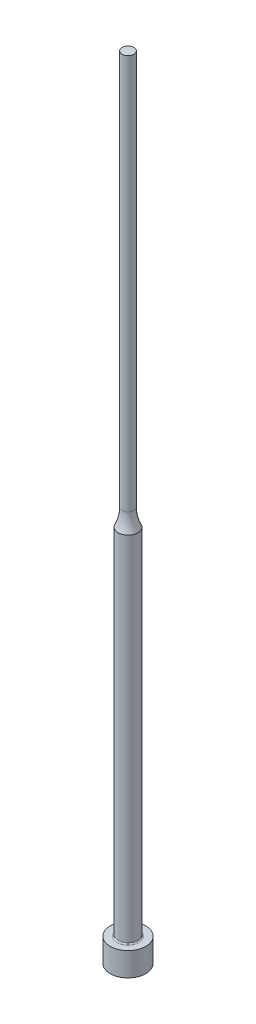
from build123d import *


with BuildPart() as part:
    # Sketch1 → Revolve1 (revolve)
    with BuildSketch(Plane.XY, mode=Mode.PRIVATE) as revolve1_sk:
        with BuildLine():
            Line((0, 0), (4.5, 0))
            Line((4.5, 0), (4.5, 6))
            Line((4.5, 6), (2.8, 6))
            ThreePointArc((2.8, 6), (2.587867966, 6.087867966), (2.5, 6.3))
            Line((2.5, 6.3), (2.5, 95.641101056))
            ThreePointArc((2.5, 95.641101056), (1.753205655, 97.763932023), (1.5, 100))
            Line((1.5, 100), (1.5, 200))
            Line((1.5, 200), (0, 200))
            Line((0, 200), (0, 0))
        make_face()
    revolve(revolve1_sk.sketch.rotate(Axis((0, 200, 0), (0, -1, 0)), 180), axis=Axis((0, 200, 0), (0, -1, 0)))


solid = part.part
